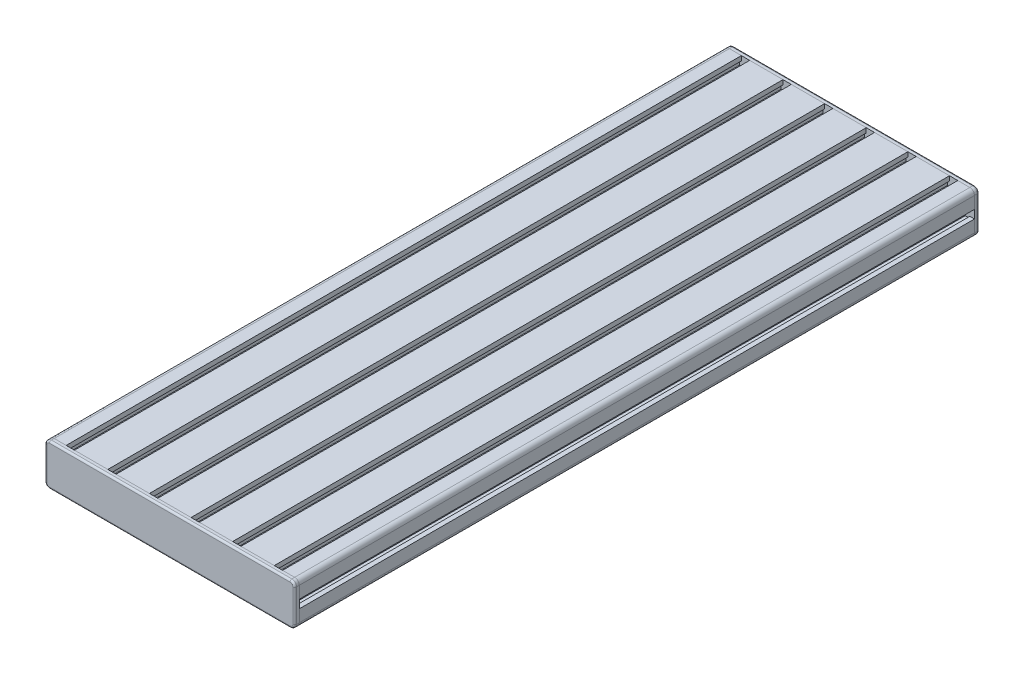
from build123d import *

# Parameters (mm, degrees)
EXTRUSION1_DEPTH      = 365
EXTRUSION1_DEPTH_BACK = 365
ESQUISSE1_R           = 10
EXTRUSION2_DEPTH      = 5
EXTRUSION3_DEPTH      = 5
CONG_1_R              = 2
CONG_2_R              = 2


with BuildPart() as part:
    # Esquisse1 → Extrusion1 (new, two sides: drawn at the far end of the back side and taken through both)
    with BuildSketch(Plane.XY.offset(-EXTRUSION1_DEPTH_BACK)):
        with BuildLine():
            Line((-130, 22.5), (-117, 22.5))
            Line((-117, 22.5), (-117, 17.5))
            Line((-117, 17.5), (-119, 17.5))
            Line((-119, 17.5), (-119, 12.5))
            Line((-119, 12.5), (-106, 12.5))
            Line((-106, 12.5), (-106, 17.5))
            Line((-106, 17.5), (-108, 17.5))
            Line((-108, 17.5), (-108, 22.5))
            Line((-108, 22.5), (-72, 22.5))
            Line((-72, 22.5), (-72, 17.5))
            Line((-72, 17.5), (-74, 17.5))
            Line((-74, 17.5), (-74, 12.5))
            Line((-74, 12.5), (-61, 12.5))
            Line((-61, 12.5), (-61, 17.5))
            Line((-61, 17.5), (-63, 17.5))
            Line((-63, 17.5), (-63, 22.5))
            Line((-63, 22.5), (-27, 22.5))
            Line((-27, 22.5), (-27, 17.5))
            Line((-27, 17.5), (-29, 17.5))
            Line((-29, 17.5), (-29, 12.5))
            Line((-29, 12.5), (-16, 12.5))
            Line((-16, 12.5), (-16, 17.5))
            Line((-16, 17.5), (-18, 17.5))
            Line((-18, 17.5), (-18, 22.5))
            Line((-18, 22.5), (18, 22.5))
            Line((18, 22.5), (18, 17.5))
            Line((18, 17.5), (16, 17.5))
            Line((16, 17.5), (16, 12.5))
            Line((16, 12.5), (29, 12.5))
            Line((29, 12.5), (29, 17.5))
            Line((29, 17.5), (27, 17.5))
            Line((27, 17.5), (27, 22.5))
            Line((27, 22.5), (63, 22.5))
            Line((63, 22.5), (63, 17.5))
            Line((63, 17.5), (61, 17.5))
            Line((61, 17.5), (61, 12.5))
            Line((61, 12.5), (74, 12.5))
            Line((74, 12.5), (74, 17.5))
            Line((74, 17.5), (72, 17.5))
            Line((72, 17.5), (72, 22.5))
            Line((72, 22.5), (108, 22.5))
            Line((108, 22.5), (108, 17.5))
            Line((108, 17.5), (106, 17.5))
            Line((106, 17.5), (106, 12.5))
            Line((106, 12.5), (119, 12.5))
            Line((119, 12.5), (119, 17.5))
            Line((119, 17.5), (117, 17.5))
            Line((117, 17.5), (117, 22.5))
            Line((117, 22.5), (130, 22.5))
            ThreePointArc((130, 22.5), (133.535533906, 21.035533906), (135, 17.5))
            Line((135, 17.5), (135, 4.5))
            Line((135, 4.5), (130, 4.5))
            Line((130, 4.5), (130, 6.5))
            Line((130, 6.5), (125, 6.5))
            Line((125, 6.5), (125, -6.5))
            Line((125, -6.5), (130, -6.5))
            Line((130, -6.5), (130, -4.5))
            Line((130, -4.5), (135, -4.5))
            Line((135, -4.5), (135, -17.5))
            ThreePointArc((135, -17.5), (133.535533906, -21.035533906), (130, -22.5))
            Line((130, -22.5), (117, -22.5))
            Line((117, -22.5), (117, -17.5))
            Line((117, -17.5), (119, -17.5))
            Line((119, -17.5), (119, -12.5))
            Line((119, -12.5), (106, -12.5))
            Line((106, -12.5), (106, -17.5))
            Line((106, -17.5), (108, -17.5))
            Line((108, -17.5), (108, -22.5))
            Line((108, -22.5), (72, -22.5))
            Line((72, -22.5), (72, -17.5))
            Line((72, -17.5), (74, -17.5))
            Line((74, -17.5), (74, -12.5))
            Line((74, -12.5), (61, -12.5))
            Line((61, -12.5), (61, -17.5))
            Line((61, -17.5), (63, -17.5))
            Line((63, -17.5), (63, -22.5))
            Line((63, -22.5), (27, -22.5))
            Line((27, -22.5), (27, -17.5))
            Line((27, -17.5), (29, -17.5))
            Line((29, -17.5), (29, -12.5))
            Line((29, -12.5), (16, -12.5))
            Line((16, -12.5), (16, -17.5))
            Line((16, -17.5), (18, -17.5))
            Line((18, -17.5), (18, -22.5))
            Line((18, -22.5), (-18, -22.5))
            Line((-18, -22.5), (-18, -17.5))
            Line((-18, -17.5), (-16, -17.5))
            Line((-16, -17.5), (-16, -12.5))
            Line((-16, -12.5), (-29, -12.5))
            Line((-29, -12.5), (-29, -17.5))
            Line((-29, -17.5), (-27, -17.5))
            Line((-27, -17.5), (-27, -22.5))
            Line((-27, -22.5), (-63, -22.5))
            Line((-63, -22.5), (-63, -17.5))
            Line((-63, -17.5), (-61, -17.5))
            Line((-61, -17.5), (-61, -12.5))
            Line((-61, -12.5), (-74, -12.5))
            Line((-74, -12.5), (-74, -17.5))
            Line((-74, -17.5), (-72, -17.5))
            Line((-72, -17.5), (-72, -22.5))
            Line((-72, -22.5), (-108, -22.5))
            Line((-108, -22.5), (-108, -17.5))
            Line((-108, -17.5), (-106, -17.5))
            Line((-106, -17.5), (-106, -12.5))
            Line((-106, -12.5), (-119, -12.5))
            Line((-119, -12.5), (-119, -17.5))
            Line((-119, -17.5), (-117, -17.5))
            Line((-117, -17.5), (-117, -22.5))
            Line((-117, -22.5), (-130, -22.5))
            ThreePointArc((-130, -22.5), (-133.535533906, -21.035533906), (-135, -17.5))
            Line((-135, -17.5), (-135, -4.5))
            Line((-135, -4.5), (-130, -4.5))
            Line((-130, -4.5), (-130, -6.5))
            Line((-130, -6.5), (-125, -6.5))
            Line((-125, -6.5), (-125, 6.5))
            Line((-125, 6.5), (-130, 6.5))
            Line((-130, 6.5), (-130, 4.5))
            Line((-130, 4.5), (-135, 4.5))
            Line((-135, 4.5), (-135, 17.5))
            ThreePointArc((-135, 17.5), (-133.535533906, 21.035533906), (-130, 22.5))
        make_face()
        with Locations((0, -4)):
            Circle(ESQUISSE1_R, mode=Mode.SUBTRACT)
        with Locations((-100, -4)):
            Circle(ESQUISSE1_R, mode=Mode.SUBTRACT)
        with Locations((-50, -4)):
            Circle(ESQUISSE1_R, mode=Mode.SUBTRACT)
        with Locations((50, -4)):
            Circle(ESQUISSE1_R, mode=Mode.SUBTRACT)
        with Locations((100, -4)):
            Circle(ESQUISSE1_R, mode=Mode.SUBTRACT)
    extrude(amount=EXTRUSION1_DEPTH + EXTRUSION1_DEPTH_BACK)


with BuildPart() as body_2:
    # Esquisse2 → Extrusion2 (new body)
    with BuildSketch(Plane.XY.offset(365)):
        with BuildLine():
            Line((135, 17.5), (135, -17.5))
            ThreePointArc((135, -17.5), (133.535533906, -21.035533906), (130, -22.5))
            Line((130, -22.5), (-130, -22.5))
            ThreePointArc((-130, -22.5), (-133.535533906, -21.035533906), (-135, -17.5))
            Line((-135, -17.5), (-135, 17.5))
            ThreePointArc((-135, 17.5), (-133.535533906, 21.035533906), (-130, 22.5))
            Line((-130, 22.5), (130, 22.5))
            ThreePointArc((130, 22.5), (133.535533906, 21.035533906), (135, 17.5))
        make_face()
    extrude(amount=EXTRUSION2_DEPTH)

    # Cong_2
    cong_2_edges = [body_2.edges().sort_by_distance(p)[0] for p in [
        (133.535533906, 21.035533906, 370),
        (0, 22.5, 370),
        (-133.535533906, 21.035533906, 370),
        (-135, 0, 370),
        (-133.535533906, -21.035533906, 370),
        (0, -22.5, 370),
        (133.535533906, -21.035533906, 370),
        (135, 0, 370),
    ]]
    fillet(cong_2_edges, radius=CONG_2_R)


with BuildPart() as body_3:
    # Esquisse3 → Extrusion3 (new body)
    with BuildSketch(Plane(origin=(0, 0, -365), x_dir=(-1, 0, 0), z_dir=(0, 0, -1))):
        with BuildLine():
            Line((-135, 17.5), (-135, -17.5))
            ThreePointArc((-135, -17.5), (-133.535533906, -21.035533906), (-130, -22.5))
            Line((-130, -22.5), (130, -22.5))
            ThreePointArc((130, -22.5), (133.535533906, -21.035533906), (135, -17.5))
            Line((135, -17.5), (135, 17.5))
            ThreePointArc((135, 17.5), (133.535533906, 21.035533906), (130, 22.5))
            Line((130, 22.5), (-130, 22.5))
            ThreePointArc((-130, 22.5), (-133.535533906, 21.035533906), (-135, 17.5))
        make_face()
    extrude(amount=EXTRUSION3_DEPTH)

    # Cong_1
    cong_1_edges = [body_3.edges().sort_by_distance(p)[0] for p in [
        (133.535533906, -21.035533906, -370),
        (0, -22.5, -370),
        (-133.535533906, -21.035533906, -370),
        (-135, 0, -370),
        (-133.535533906, 21.035533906, -370),
        (0, 22.5, -370),
        (133.535533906, 21.035533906, -370),
        (135, 0, -370),
    ]]
    fillet(cong_1_edges, radius=CONG_1_R)


solid = Compound([part.part, body_2.part, body_3.part])
